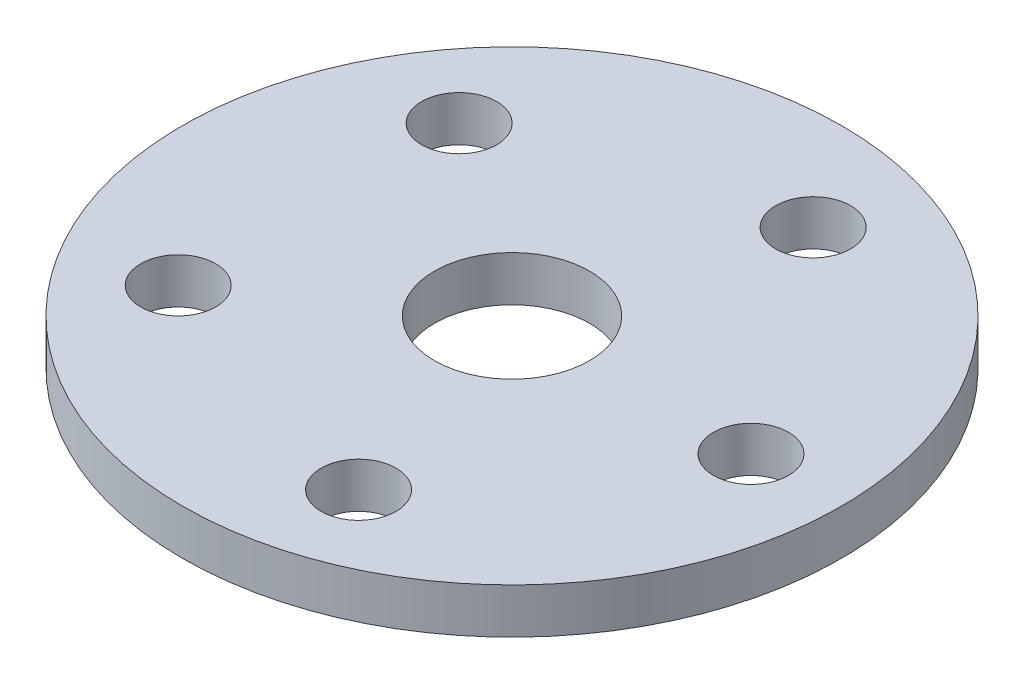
from build123d import *

# Parameters (mm, degrees)
SKETCH1_R          = 64.755865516
EXTRUDE1_DEPTH     = 8.89
SKETCH2_R          = 7.366886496
CUT_EXTRUDE1_DEPTH = 8.89
SKETCH3_R          = 15.246091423
CUT_EXTRUDE2_DEPTH = 8.89
CIRPATTERN1_COUNT  = 5


with BuildPart() as part:
    # Sketch1 → Extrude1 (new body)
    with BuildSketch(Plane(origin=(0, 0, 0), x_dir=(1, 0, 0), z_dir=(0, 1, 0))):
        with Locations(Location((0, 0, 0), (0, 0, 270))):
            Circle(SKETCH1_R)
    extrude(amount=EXTRUDE1_DEPTH)

    # Sketch2 → Cut-Extrude1 (cut)
    with BuildSketch(Plane(origin=(0, 8.89, 0), x_dir=(-1, 0, 0), z_dir=(0, 1, 0))):
        with Locations(Location((-46.957163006, 0, 0), (0, 0, 90))):
            Circle(SKETCH2_R)
    cut_extrude1 = extrude(amount=-CUT_EXTRUDE1_DEPTH, mode=Mode.SUBTRACT)

    # Sketch3 → Cut-Extrude2 (cut)
    with BuildSketch(Plane(origin=(0, 8.89, 0), x_dir=(-1, 0, 0), z_dir=(0, 1, 0))):
        with Locations(Location((0, 0, 0), (0, 0, 90))):
            Circle(SKETCH3_R)
    extrude(amount=-CUT_EXTRUDE2_DEPTH, mode=Mode.SUBTRACT)

    # CirPattern1: Cut-Extrude1 ×5 about axis
    cirpattern1_axis = Axis((0, 0, 0), (0, 1, 0))
    for i in range(1, CIRPATTERN1_COUNT):
        add(cut_extrude1.rotate(cirpattern1_axis, i * 360 / CIRPATTERN1_COUNT), mode=Mode.SUBTRACT)


solid = part.part
